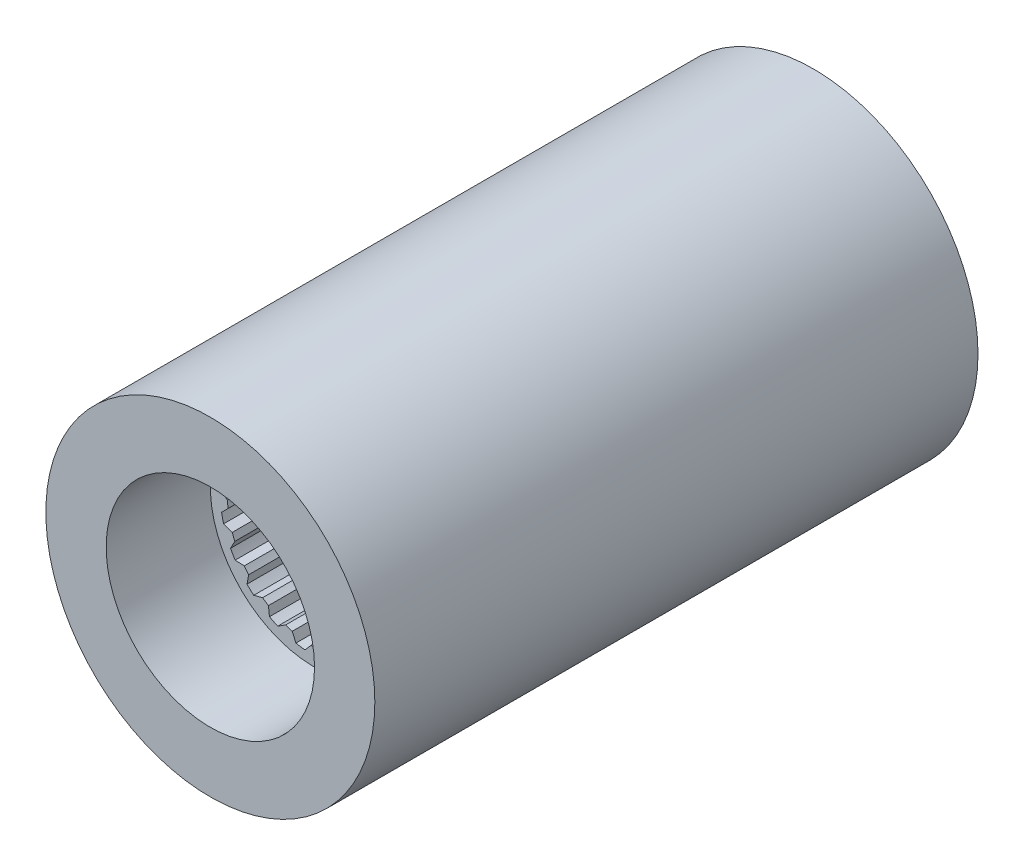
from build123d import *

# Parameters (mm, degrees)
SKETCH1_R           = 19.05
BOSS_EXTRUDE1_DEPTH = 69.85
SKETCH2_R           = 12.065
CUT_EXTRUDE1_DEPTH  = 12.065
CUT_EXTRUDE2_START  = -12.065
SKETCH3_R           = 12.065
CUT_EXTRUDE2_DEPTH  = 12.065
SKETCH4_R           = 11.43
CUT_EXTRUDE3_DEPTH  = 2.032
CUT_EXTRUDE4_START  = 2.032
SKETCH5_R           = 11.43
CUT_EXTRUDE4_DEPTH  = 2.032


with BuildPart() as part:
    # Sketch1 → Boss-Extrude1 (new body)
    with BuildSketch(Plane.XY):
        Circle(SKETCH1_R)
        with BuildLine():
            Line((-1.099913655, 10.023632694), (-0.533242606, 10.921690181))
            ThreePointArc((-0.533242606, 10.921690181), (0, 10.9347), (0.533242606, 10.921690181))
            Line((0.533242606, 10.921690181), (1.099913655, 10.023632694))
            ThreePointArc((1.099913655, 10.023632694), (1.502912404, 9.971172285), (1.903470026, 9.902516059))
            Line((1.903470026, 9.902516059), (2.709672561, 10.593646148))
            ThreePointArc((2.709672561, 10.593646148), (3.223059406, 10.448901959), (3.728776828, 10.279294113))
            Line((3.728776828, 10.279294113), (4.00556518, 9.254105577))
            ThreePointArc((4.00556518, 9.254105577), (4.375196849, 9.08518987), (4.737722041, 8.901517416))
            Line((4.737722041, 8.901517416), (5.71182143, 9.324310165))
            ThreePointArc((5.71182143, 9.324310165), (6.159735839, 9.034673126), (6.592992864, 8.723537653))
            Line((6.592992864, 8.723537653), (6.555304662, 7.662310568))
            ThreePointArc((6.555304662, 7.662310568), (6.858725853, 7.391948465), (7.151006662, 7.109579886))
            Line((7.151006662, 7.109579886), (8.206449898, 7.226468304))
            ThreePointArc((8.206449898, 7.226468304), (8.549092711, 6.817673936), (8.871392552, 6.39265659))
            Line((8.871392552, 6.39265659), (8.522576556, 5.389685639))
            ThreePointArc((8.522576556, 5.389685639), (8.732826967, 5.0419), (8.92889296, 4.685924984))
            Line((8.92889296, 4.685924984), (9.97189928, 4.486523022))
            ThreePointArc((9.97189928, 4.486523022), (10.178825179, 3.994894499), (10.36153008, 3.493759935))
            Line((10.36153008, 3.493759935), (9.732580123, 2.638163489))
            ThreePointArc((9.732580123, 2.638163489), (9.830978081, 2.243856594), (9.913407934, 1.845905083))
            Line((9.913407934, 1.845905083), (10.85130165, 1.347930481))
            ThreePointArc((10.85130165, 1.347930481), (10.904124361, 0.817151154), (10.93100019, 0.284427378))
            Line((10.93100019, 0.284427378), (10.077801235, -0.347771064))
            ThreePointArc((10.077801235, -0.347771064), (10.05560365, -0.753563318), (10.017073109, -1.158131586))
            Line((10.017073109, -1.158131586), (10.766518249, -1.910431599))
            ThreePointArc((10.766518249, -1.910431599), (10.660544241, -2.433199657), (10.529202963, -2.9501778))
            Line((10.529202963, -2.9501778), (9.527565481, -3.302804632))
            ThreePointArc((9.527565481, -3.302804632), (9.386744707, -3.684025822), (9.230677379, -4.05926318))
            Line((9.230677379, -4.05926318), (9.725082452, -4.999043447))
            ThreePointArc((9.725082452, -4.999043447), (9.469727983, -5.46735), (9.191839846, -5.922646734))
            Line((9.191839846, -5.922646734), (8.130763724, -5.964369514))
            ThreePointArc((8.130763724, -5.964369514), (7.883832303, -6.287146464), (7.624095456, -6.599711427))
            Line((7.624095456, -6.599711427), (7.819530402, -7.643468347))
            ThreePointArc((7.819530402, -7.643468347), (7.437484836, -8.015702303), (7.037741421, -8.368862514))
            Line((7.037741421, -8.368862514), (6.011507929, -8.095973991))
            ThreePointArc((6.011507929, -8.095973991), (5.680406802, -8.331626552), (5.340079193, -8.553746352))
            Line((5.340079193, -8.553746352), (5.219178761, -9.608737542))
            ThreePointArc((5.219178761, -9.608737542), (4.744388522, -9.85182428), (4.258308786, -10.071468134))
            Line((4.258308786, -10.071468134), (3.358103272, -9.50821565))
            ThreePointArc((3.358103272, -9.50821565), (2.972252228, -9.635805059), (2.58157346, -9.747743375))
            Line((2.58157346, -9.747743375), (2.155080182, -10.720228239))
            ThreePointArc((2.155080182, -10.720228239), (1.629732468, -10.812568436), (1.100506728, -10.879179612))
            Line((1.100506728, -10.879179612), (0.406316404, -10.075610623))
            ThreePointArc((0.406316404, -10.075610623), (0, -10.0838), (-0.406316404, -10.075610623))
            Line((-0.406316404, -10.075610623), (-1.100506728, -10.879179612))
            ThreePointArc((-1.100506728, -10.879179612), (-1.629732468, -10.812568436), (-2.155080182, -10.720228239))
            Line((-2.155080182, -10.720228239), (-2.58157346, -9.747743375))
            ThreePointArc((-2.58157346, -9.747743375), (-2.972252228, -9.635805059), (-3.358103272, -9.50821565))
            Line((-3.358103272, -9.50821565), (-4.258308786, -10.071468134))
            ThreePointArc((-4.258308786, -10.071468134), (-4.744388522, -9.85182428), (-5.219178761, -9.608737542))
            Line((-5.219178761, -9.608737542), (-5.340079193, -8.553746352))
            ThreePointArc((-5.340079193, -8.553746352), (-5.680406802, -8.331626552), (-6.011507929, -8.095973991))
            Line((-6.011507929, -8.095973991), (-7.037741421, -8.368862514))
            ThreePointArc((-7.037741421, -8.368862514), (-7.437484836, -8.015702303), (-7.819530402, -7.643468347))
            Line((-7.819530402, -7.643468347), (-7.624095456, -6.599711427))
            ThreePointArc((-7.624095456, -6.599711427), (-7.883832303, -6.287146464), (-8.130763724, -5.964369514))
            Line((-8.130763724, -5.964369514), (-9.191839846, -5.922646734))
            ThreePointArc((-9.191839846, -5.922646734), (-9.469727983, -5.46735), (-9.725082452, -4.999043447))
            Line((-9.725082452, -4.999043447), (-9.230677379, -4.05926318))
            ThreePointArc((-9.230677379, -4.05926318), (-9.386744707, -3.684025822), (-9.527565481, -3.302804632))
            Line((-9.527565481, -3.302804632), (-10.529202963, -2.9501778))
            ThreePointArc((-10.529202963, -2.9501778), (-10.660544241, -2.433199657), (-10.766518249, -1.910431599))
            Line((-10.766518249, -1.910431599), (-10.017073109, -1.158131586))
            ThreePointArc((-10.017073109, -1.158131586), (-10.05560365, -0.753563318), (-10.077801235, -0.347771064))
            Line((-10.077801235, -0.347771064), (-10.93100019, 0.284427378))
            ThreePointArc((-10.93100019, 0.284427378), (-10.904124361, 0.817151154), (-10.85130165, 1.347930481))
            Line((-10.85130165, 1.347930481), (-9.913407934, 1.845905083))
            ThreePointArc((-9.913407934, 1.845905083), (-9.830978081, 2.243856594), (-9.732580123, 2.638163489))
            Line((-9.732580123, 2.638163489), (-10.36153008, 3.493759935))
            ThreePointArc((-10.36153008, 3.493759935), (-10.178825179, 3.994894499), (-9.97189928, 4.486523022))
            Line((-9.97189928, 4.486523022), (-8.92889296, 4.685924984))
            ThreePointArc((-8.92889296, 4.685924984), (-8.732826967, 5.0419), (-8.522576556, 5.389685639))
            Line((-8.522576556, 5.389685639), (-8.871392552, 6.39265659))
            ThreePointArc((-8.871392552, 6.39265659), (-8.549092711, 6.817673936), (-8.206449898, 7.226468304))
            Line((-8.206449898, 7.226468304), (-7.151006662, 7.109579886))
            ThreePointArc((-7.151006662, 7.109579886), (-6.858725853, 7.391948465), (-6.555304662, 7.662310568))
            Line((-6.555304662, 7.662310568), (-6.592992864, 8.723537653))
            ThreePointArc((-6.592992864, 8.723537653), (-6.159735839, 9.034673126), (-5.71182143, 9.324310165))
            Line((-5.71182143, 9.324310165), (-4.737722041, 8.901517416))
            ThreePointArc((-4.737722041, 8.901517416), (-4.375196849, 9.08518987), (-4.00556518, 9.254105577))
            Line((-4.00556518, 9.254105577), (-3.728776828, 10.279294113))
            ThreePointArc((-3.728776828, 10.279294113), (-3.223059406, 10.448901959), (-2.709672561, 10.593646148))
            Line((-2.709672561, 10.593646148), (-1.903470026, 9.902516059))
            ThreePointArc((-1.903470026, 9.902516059), (-1.502912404, 9.971172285), (-1.099913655, 10.023632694))
        make_face(mode=Mode.SUBTRACT)
    extrude(amount=BOSS_EXTRUDE1_DEPTH)

    # Sketch2 → Cut-Extrude1 (cut)
    with BuildSketch(Plane.XY.offset(69.85)):
        Circle(SKETCH2_R)
    extrude(amount=-CUT_EXTRUDE1_DEPTH, mode=Mode.SUBTRACT)

    # Sketch3 → Cut-Extrude2 (cut)
    with BuildSketch(Plane(origin=(0, 0, 0), x_dir=(-1, 0, 0), z_dir=(0, 0, -1)).offset(CUT_EXTRUDE2_START)):
        with Locations(Location((0, 0, 0), (0, 0, 180))):
            Circle(SKETCH3_R)
    extrude(amount=CUT_EXTRUDE2_DEPTH, mode=Mode.SUBTRACT)

    # Sketch4 → Cut-Extrude3 (cut)
    with BuildSketch(Plane.XY.offset(29.21)):
        Circle(SKETCH4_R)
    extrude(amount=-CUT_EXTRUDE3_DEPTH, mode=Mode.SUBTRACT)

    # Sketch5 → Cut-Extrude4 (cut)
    with BuildSketch(Plane.XY.offset(40.64).offset(CUT_EXTRUDE4_START)):
        Circle(SKETCH5_R)
    extrude(amount=-CUT_EXTRUDE4_DEPTH, mode=Mode.SUBTRACT)


solid = part.part
